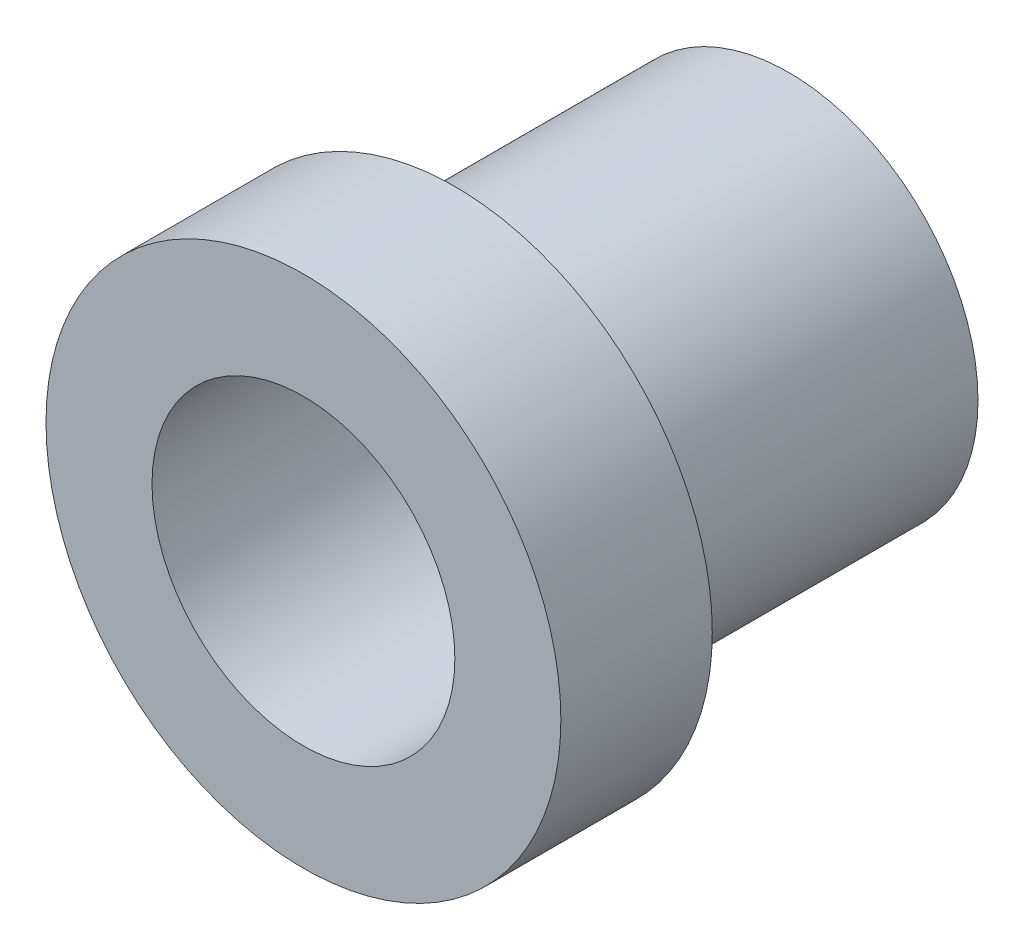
ISO-10303-21;
HEADER;
FILE_DESCRIPTION(('STEP AP214'),'2;1');
FILE_NAME('part.step','',(''),(''),'','','');
FILE_SCHEMA(('AUTOMOTIVE_DESIGN { 1 0 10303 214 1 1 1 1 }'));
ENDSEC;
DATA;
#1=APPLICATION_CONTEXT('core data for automotive mechanical design processes');
#2=APPLICATION_PROTOCOL_DEFINITION('international standard','automotive_design',2000,#1);
#3=PRODUCT_CONTEXT('',#1,'mechanical');
#4=PRODUCT('Part','Part','',(#3));
#5=PRODUCT_RELATED_PRODUCT_CATEGORY('part','',(#4));
#6=PRODUCT_DEFINITION_FORMATION('','',#4);
#7=PRODUCT_DEFINITION_CONTEXT('part definition',#1,'design');
#8=PRODUCT_DEFINITION('design','',#6,#7);
#9=PRODUCT_DEFINITION_SHAPE('','',#8);
#10=(LENGTH_UNIT() NAMED_UNIT(*) SI_UNIT(.MILLI.,.METRE.));
#11=(NAMED_UNIT(*) PLANE_ANGLE_UNIT() SI_UNIT($,.RADIAN.));
#12=(NAMED_UNIT(*) SI_UNIT($,.STERADIAN.) SOLID_ANGLE_UNIT());
#13=UNCERTAINTY_MEASURE_WITH_UNIT(LENGTH_MEASURE(1.E-05),#10,'distance_accuracy_value','');
#14=(GEOMETRIC_REPRESENTATION_CONTEXT(3) GLOBAL_UNCERTAINTY_ASSIGNED_CONTEXT((#13)) GLOBAL_UNIT_ASSIGNED_CONTEXT((#10,
#11,#12)) REPRESENTATION_CONTEXT('',''));
#15=CARTESIAN_POINT('',(0.,0.,0.));
#16=DIRECTION('',(0.,0.,1.));
#17=DIRECTION('',(1.,0.,0.));
#18=AXIS2_PLACEMENT_3D('',#15,#16,#17);
#19=CARTESIAN_POINT('',(0.,0.,0.));
#20=DIRECTION('',(0.,0.,1.));
#21=DIRECTION('',(1.,0.,0.));
#22=AXIS2_PLACEMENT_3D('',#19,#20,#21);
#23=PLANE('',#22);
#24=CARTESIAN_POINT('',(0.,0.,0.));
#25=DIRECTION('',(0.,0.,1.));
#26=DIRECTION('',(1.,0.,0.));
#27=AXIS2_PLACEMENT_3D('',#24,#25,#26);
#28=CIRCLE('',#27,5.3975);
#29=CARTESIAN_POINT('',(5.3975,0.,0.));
#30=VERTEX_POINT('',#29);
#31=EDGE_CURVE('E42',#30,#30,#28,.T.);
#32=ORIENTED_EDGE('',*,*,#31,.F.);
#33=EDGE_LOOP('',(#32));
#34=FACE_BOUND('',#33,.T.);
#35=CARTESIAN_POINT('',(0.,0.,0.));
#36=DIRECTION('',(0.,0.,1.));
#37=DIRECTION('',(1.,0.,0.));
#38=AXIS2_PLACEMENT_3D('',#35,#36,#37);
#39=CIRCLE('',#38,3.96875);
#40=CARTESIAN_POINT('',(3.96875,0.,0.));
#41=VERTEX_POINT('',#40);
#42=EDGE_CURVE('E10',#41,#41,#39,.F.);
#43=ORIENTED_EDGE('',*,*,#42,.F.);
#44=EDGE_LOOP('',(#43));
#45=FACE_BOUND('',#44,.T.);
#46=ADVANCED_FACE('F31',(#34,#45),#23,.F.);
#47=CARTESIAN_POINT('',(0.,0.,3.175));
#48=DIRECTION('',(0.,0.,1.));
#49=DIRECTION('',(1.,0.,0.));
#50=AXIS2_PLACEMENT_3D('',#47,#48,#49);
#51=PLANE('',#50);
#52=CARTESIAN_POINT('',(0.,0.,3.175));
#53=DIRECTION('',(0.,0.,1.));
#54=DIRECTION('',(1.,0.,0.));
#55=AXIS2_PLACEMENT_3D('',#52,#53,#54);
#56=CIRCLE('',#55,5.3975);
#57=CARTESIAN_POINT('',(5.3975,0.,3.175));
#58=VERTEX_POINT('',#57);
#59=EDGE_CURVE('E38',#58,#58,#56,.T.);
#60=ORIENTED_EDGE('',*,*,#59,.T.);
#61=EDGE_LOOP('',(#60));
#62=FACE_BOUND('',#61,.T.);
#63=CARTESIAN_POINT('',(0.,0.,3.175));
#64=DIRECTION('',(0.,0.,1.));
#65=DIRECTION('',(1.,0.,0.));
#66=AXIS2_PLACEMENT_3D('',#63,#64,#65);
#67=CIRCLE('',#66,3.175);
#68=CARTESIAN_POINT('',(3.175,0.,3.175));
#69=VERTEX_POINT('',#68);
#70=EDGE_CURVE('E47',#69,#69,#67,.T.);
#71=ORIENTED_EDGE('',*,*,#70,.F.);
#72=EDGE_LOOP('',(#71));
#73=FACE_BOUND('',#72,.T.);
#74=ADVANCED_FACE('F74',(#62,#73),#51,.T.);
#75=CARTESIAN_POINT('',(0.,0.,3.175));
#76=DIRECTION('',(0.,0.,-1.));
#77=DIRECTION('',(-1.,0.,0.));
#78=AXIS2_PLACEMENT_3D('',#75,#76,#77);
#79=CYLINDRICAL_SURFACE('',#78,5.3975);
#80=ORIENTED_EDGE('',*,*,#59,.F.);
#81=EDGE_LOOP('',(#80));
#82=FACE_BOUND('',#81,.T.);
#83=ORIENTED_EDGE('',*,*,#31,.T.);
#84=EDGE_LOOP('',(#83));
#85=FACE_BOUND('',#84,.T.);
#86=ADVANCED_FACE('F33',(#82,#85),#79,.T.);
#87=CARTESIAN_POINT('',(0.,0.,3.175));
#88=DIRECTION('',(0.,0.,-1.));
#89=DIRECTION('',(-1.,0.,0.));
#90=AXIS2_PLACEMENT_3D('',#87,#88,#89);
#91=CYLINDRICAL_SURFACE('',#90,3.175);
#92=ORIENTED_EDGE('',*,*,#70,.T.);
#93=EDGE_LOOP('',(#92));
#94=FACE_BOUND('',#93,.T.);
#95=CARTESIAN_POINT('',(0.,0.,-7.));
#96=DIRECTION('',(0.,0.,-1.));
#97=DIRECTION('',(-1.,0.,0.));
#98=AXIS2_PLACEMENT_3D('',#95,#96,#97);
#99=CIRCLE('',#98,3.175);
#100=CARTESIAN_POINT('',(-3.175,0.,-7.));
#101=VERTEX_POINT('',#100);
#102=EDGE_CURVE('E54',#101,#101,#99,.T.);
#103=ORIENTED_EDGE('',*,*,#102,.T.);
#104=EDGE_LOOP('',(#103));
#105=FACE_BOUND('',#104,.T.);
#106=ADVANCED_FACE('F58',(#94,#105),#91,.F.);
#107=CARTESIAN_POINT('',(0.,0.,-7.));
#108=DIRECTION('',(0.,0.,-1.));
#109=DIRECTION('',(-1.,0.,0.));
#110=AXIS2_PLACEMENT_3D('',#107,#108,#109);
#111=PLANE('',#110);
#112=CARTESIAN_POINT('',(0.,0.,-7.));
#113=DIRECTION('',(0.,0.,-1.));
#114=DIRECTION('',(-1.,0.,0.));
#115=AXIS2_PLACEMENT_3D('',#112,#113,#114);
#116=CIRCLE('',#115,3.96875);
#117=CARTESIAN_POINT('',(-3.96875,0.,-7.));
#118=VERTEX_POINT('',#117);
#119=EDGE_CURVE('E51',#118,#118,#116,.T.);
#120=ORIENTED_EDGE('',*,*,#119,.T.);
#121=EDGE_LOOP('',(#120));
#122=FACE_BOUND('',#121,.T.);
#123=ORIENTED_EDGE('',*,*,#102,.F.);
#124=EDGE_LOOP('',(#123));
#125=FACE_BOUND('',#124,.T.);
#126=ADVANCED_FACE('F60',(#122,#125),#111,.T.);
#127=CARTESIAN_POINT('',(0.,0.,-7.));
#128=DIRECTION('',(0.,0.,1.));
#129=DIRECTION('',(1.,0.,0.));
#130=AXIS2_PLACEMENT_3D('',#127,#128,#129);
#131=CYLINDRICAL_SURFACE('',#130,3.96875);
#132=ORIENTED_EDGE('',*,*,#119,.F.);
#133=EDGE_LOOP('',(#132));
#134=FACE_BOUND('',#133,.T.);
#135=ORIENTED_EDGE('',*,*,#42,.T.);
#136=EDGE_LOOP('',(#135));
#137=FACE_BOUND('',#136,.T.);
#138=ADVANCED_FACE('F62',(#134,#137),#131,.T.);
#139=CLOSED_SHELL('',(#46,#74,#86,#106,#126,#138));
#140=MANIFOLD_SOLID_BREP('B2',#139);
#141=ADVANCED_BREP_SHAPE_REPRESENTATION('',(#18,#140),#14);
#142=SHAPE_DEFINITION_REPRESENTATION(#9,#141);
ENDSEC;
END-ISO-10303-21;
